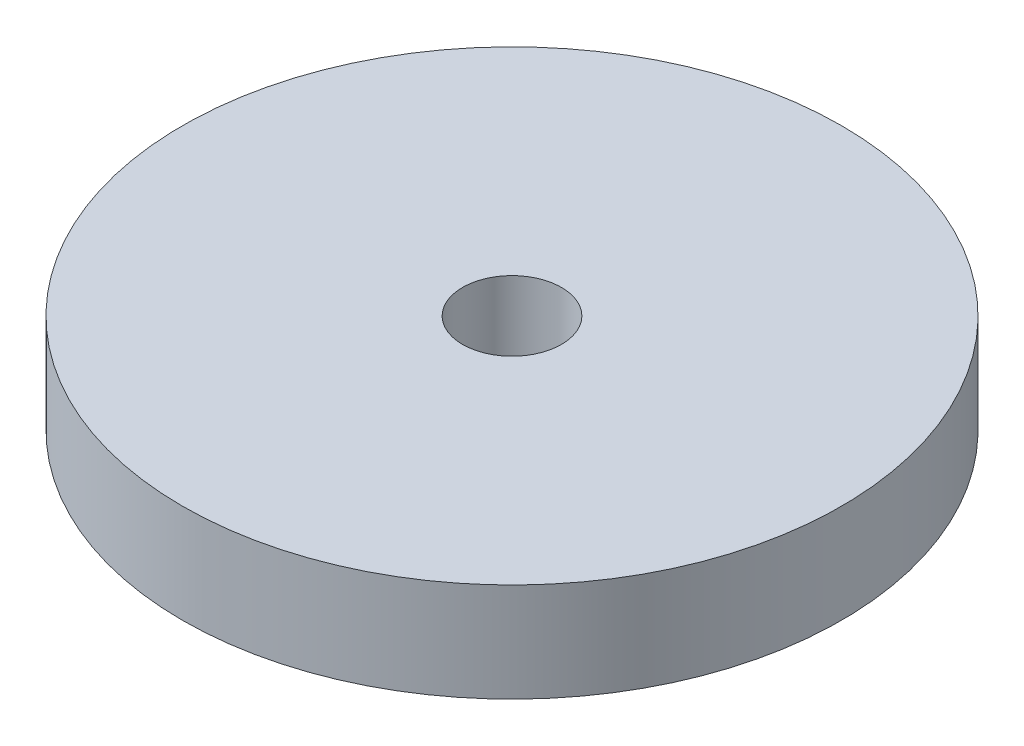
ISO-10303-21;
HEADER;
FILE_DESCRIPTION(('STEP AP214'),'2;1');
FILE_NAME('part.step','',(''),(''),'','','');
FILE_SCHEMA(('AUTOMOTIVE_DESIGN { 1 0 10303 214 1 1 1 1 }'));
ENDSEC;
DATA;
#1=APPLICATION_CONTEXT('core data for automotive mechanical design processes');
#2=APPLICATION_PROTOCOL_DEFINITION('international standard','automotive_design',2000,#1);
#3=PRODUCT_CONTEXT('',#1,'mechanical');
#4=PRODUCT('Part','Part','',(#3));
#5=PRODUCT_RELATED_PRODUCT_CATEGORY('part','',(#4));
#6=PRODUCT_DEFINITION_FORMATION('','',#4);
#7=PRODUCT_DEFINITION_CONTEXT('part definition',#1,'design');
#8=PRODUCT_DEFINITION('design','',#6,#7);
#9=PRODUCT_DEFINITION_SHAPE('','',#8);
#10=(LENGTH_UNIT() NAMED_UNIT(*) SI_UNIT(.MILLI.,.METRE.));
#11=(NAMED_UNIT(*) PLANE_ANGLE_UNIT() SI_UNIT($,.RADIAN.));
#12=(NAMED_UNIT(*) SI_UNIT($,.STERADIAN.) SOLID_ANGLE_UNIT());
#13=UNCERTAINTY_MEASURE_WITH_UNIT(LENGTH_MEASURE(1.E-05),#10,'distance_accuracy_value','');
#14=(GEOMETRIC_REPRESENTATION_CONTEXT(3) GLOBAL_UNCERTAINTY_ASSIGNED_CONTEXT((#13)) GLOBAL_UNIT_ASSIGNED_CONTEXT((#10,
#11,#12)) REPRESENTATION_CONTEXT('',''));
#15=CARTESIAN_POINT('',(0.,0.,0.));
#16=DIRECTION('',(0.,0.,1.));
#17=DIRECTION('',(1.,0.,0.));
#18=AXIS2_PLACEMENT_3D('',#15,#16,#17);
#19=CARTESIAN_POINT('',(0.,6.,0.));
#20=DIRECTION('',(0.,-1.,0.));
#21=DIRECTION('',(0.,0.,-1.));
#22=AXIS2_PLACEMENT_3D('',#19,#20,#21);
#23=CYLINDRICAL_SURFACE('',#22,20.);
#24=CARTESIAN_POINT('',(0.,6.,0.));
#25=DIRECTION('',(0.,1.,0.));
#26=DIRECTION('',(0.,0.,1.));
#27=AXIS2_PLACEMENT_3D('',#24,#25,#26);
#28=CIRCLE('',#27,20.);
#29=CARTESIAN_POINT('',(0.,6.,20.));
#30=VERTEX_POINT('',#29);
#31=EDGE_CURVE('E10',#30,#30,#28,.T.);
#32=ORIENTED_EDGE('',*,*,#31,.F.);
#33=EDGE_LOOP('',(#32));
#34=FACE_BOUND('',#33,.T.);
#35=CARTESIAN_POINT('',(0.,0.,0.));
#36=DIRECTION('',(0.,1.,0.));
#37=DIRECTION('',(0.,0.,1.));
#38=AXIS2_PLACEMENT_3D('',#35,#36,#37);
#39=CIRCLE('',#38,20.);
#40=CARTESIAN_POINT('',(0.,0.,20.));
#41=VERTEX_POINT('',#40);
#42=EDGE_CURVE('E31',#41,#41,#39,.T.);
#43=ORIENTED_EDGE('',*,*,#42,.T.);
#44=EDGE_LOOP('',(#43));
#45=FACE_BOUND('',#44,.T.);
#46=ADVANCED_FACE('F25',(#34,#45),#23,.T.);
#47=CARTESIAN_POINT('',(0.,6.,0.));
#48=DIRECTION('',(0.,1.,0.));
#49=DIRECTION('',(0.,0.,1.));
#50=AXIS2_PLACEMENT_3D('',#47,#48,#49);
#51=PLANE('',#50);
#52=CARTESIAN_POINT('',(0.,6.,0.));
#53=DIRECTION('',(0.,1.,0.));
#54=DIRECTION('',(0.,0.,1.));
#55=AXIS2_PLACEMENT_3D('',#52,#53,#54);
#56=CIRCLE('',#55,3.);
#57=CARTESIAN_POINT('',(0.,6.,3.));
#58=VERTEX_POINT('',#57);
#59=EDGE_CURVE('E39',#58,#58,#56,.T.);
#60=ORIENTED_EDGE('',*,*,#59,.F.);
#61=EDGE_LOOP('',(#60));
#62=FACE_BOUND('',#61,.T.);
#63=ORIENTED_EDGE('',*,*,#31,.T.);
#64=EDGE_LOOP('',(#63));
#65=FACE_BOUND('',#64,.T.);
#66=ADVANCED_FACE('F47',(#62,#65),#51,.T.);
#67=CARTESIAN_POINT('',(0.,0.,0.));
#68=DIRECTION('',(0.,1.,0.));
#69=DIRECTION('',(0.,0.,1.));
#70=AXIS2_PLACEMENT_3D('',#67,#68,#69);
#71=PLANE('',#70);
#72=CARTESIAN_POINT('',(0.,0.,0.));
#73=DIRECTION('',(0.,1.,0.));
#74=DIRECTION('',(0.,0.,1.));
#75=AXIS2_PLACEMENT_3D('',#72,#73,#74);
#76=CIRCLE('',#75,3.);
#77=CARTESIAN_POINT('',(0.,0.,3.));
#78=VERTEX_POINT('',#77);
#79=EDGE_CURVE('E35',#78,#78,#76,.T.);
#80=ORIENTED_EDGE('',*,*,#79,.T.);
#81=EDGE_LOOP('',(#80));
#82=FACE_BOUND('',#81,.T.);
#83=ORIENTED_EDGE('',*,*,#42,.F.);
#84=EDGE_LOOP('',(#83));
#85=FACE_BOUND('',#84,.T.);
#86=ADVANCED_FACE('F49',(#82,#85),#71,.F.);
#87=CARTESIAN_POINT('',(0.,0.,0.));
#88=DIRECTION('',(0.,1.,0.));
#89=DIRECTION('',(0.,0.,1.));
#90=AXIS2_PLACEMENT_3D('',#87,#88,#89);
#91=CYLINDRICAL_SURFACE('',#90,3.);
#92=ORIENTED_EDGE('',*,*,#79,.F.);
#93=EDGE_LOOP('',(#92));
#94=FACE_BOUND('',#93,.T.);
#95=ORIENTED_EDGE('',*,*,#59,.T.);
#96=EDGE_LOOP('',(#95));
#97=FACE_BOUND('',#96,.T.);
#98=ADVANCED_FACE('F45',(#94,#97),#91,.F.);
#99=CLOSED_SHELL('',(#46,#66,#86,#98));
#100=MANIFOLD_SOLID_BREP('B2',#99);
#101=ADVANCED_BREP_SHAPE_REPRESENTATION('',(#18,#100),#14);
#102=SHAPE_DEFINITION_REPRESENTATION(#9,#101);
ENDSEC;
END-ISO-10303-21;
